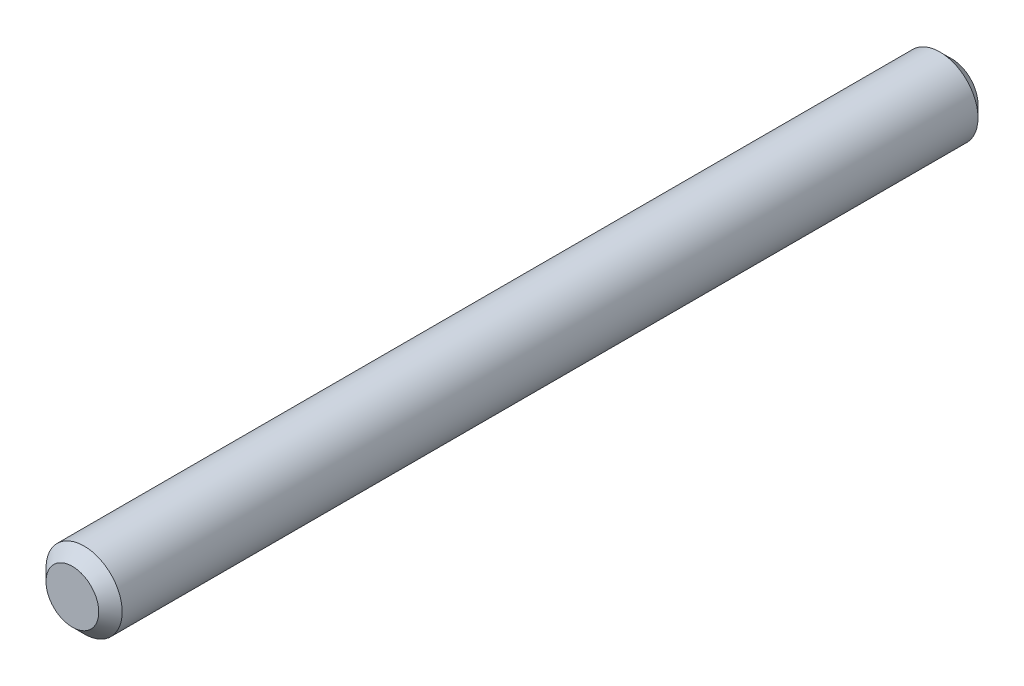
from build123d import *

# Parameters (mm, degrees)
ESQUISSE1_R          = 0.65
BASE_EXTRUSION_DEPTH = 15
CHANFREIN1_SIZE      = 0.2


with BuildPart() as part:
    # Esquisse1 → Base-Extrusion (new body)
    with BuildSketch(Plane.XY):
        Circle(ESQUISSE1_R)
    extrude(amount=BASE_EXTRUSION_DEPTH)

    # Chanfrein1
    chanfrein1_edges = [part.edges().sort_by_distance(p)[0] for p in [
        (-0.65, 0, 0),
        (-0.65, 0, 15),
    ]]
    chamfer(chanfrein1_edges, length=CHANFREIN1_SIZE)


solid = part.part
